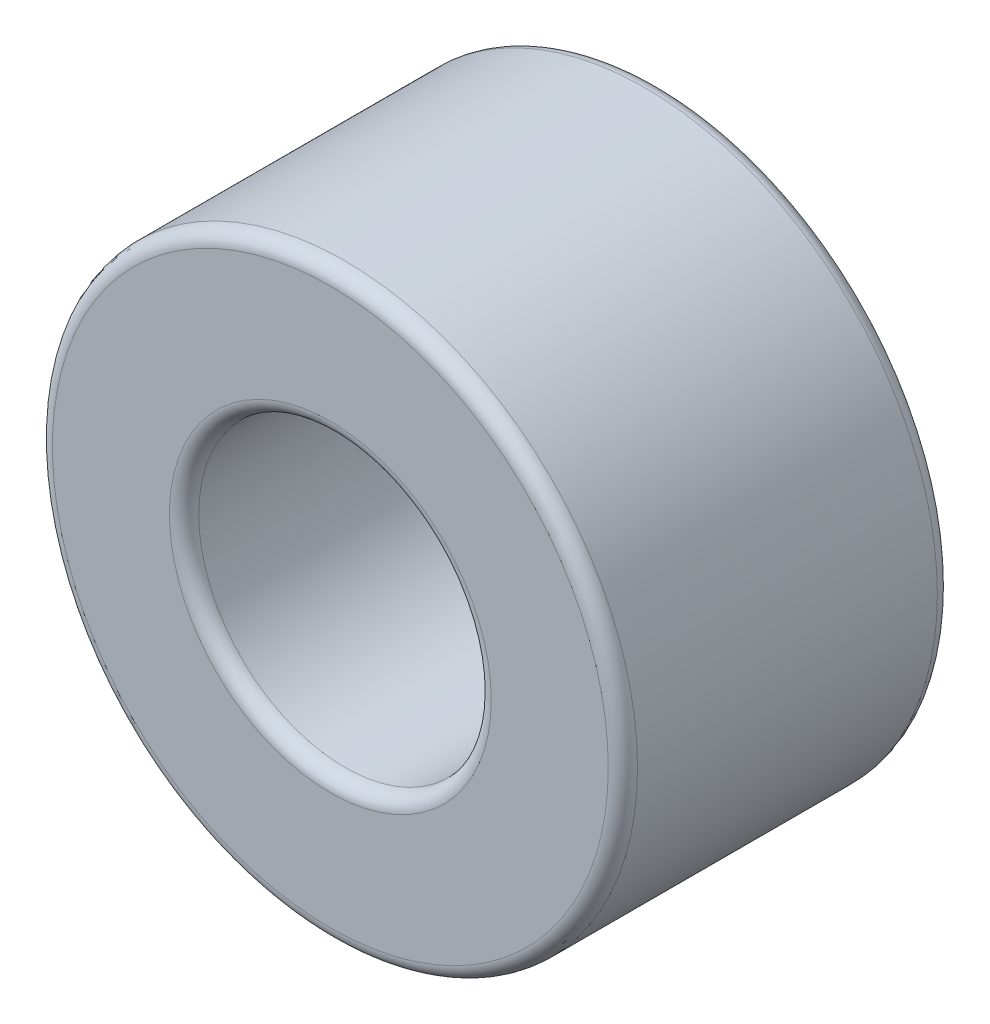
from build123d import *

# Parameters (mm, degrees)
ESQUISSE1_R      = 4
ESQUISSE1_R_2    = 2
EXTRUSION1_DEPTH = 4.5
CONG_1_R         = 0.2


with BuildPart() as part:
    # Esquisse1 → Extrusion1 (new body)
    with BuildSketch(Plane.XY):
        Circle(ESQUISSE1_R)
        Circle(ESQUISSE1_R_2, mode=Mode.SUBTRACT)
    extrude(amount=EXTRUSION1_DEPTH)

    # Cong_1
    cong_1_edges = [part.edges().sort_by_distance(p)[0] for p in [
        (-4, 0, 0),
        (-4, 0, 4.5),
        (-2, 0, 0),
        (-2, 0, 4.5),
    ]]
    fillet(cong_1_edges, radius=CONG_1_R)


solid = part.part
